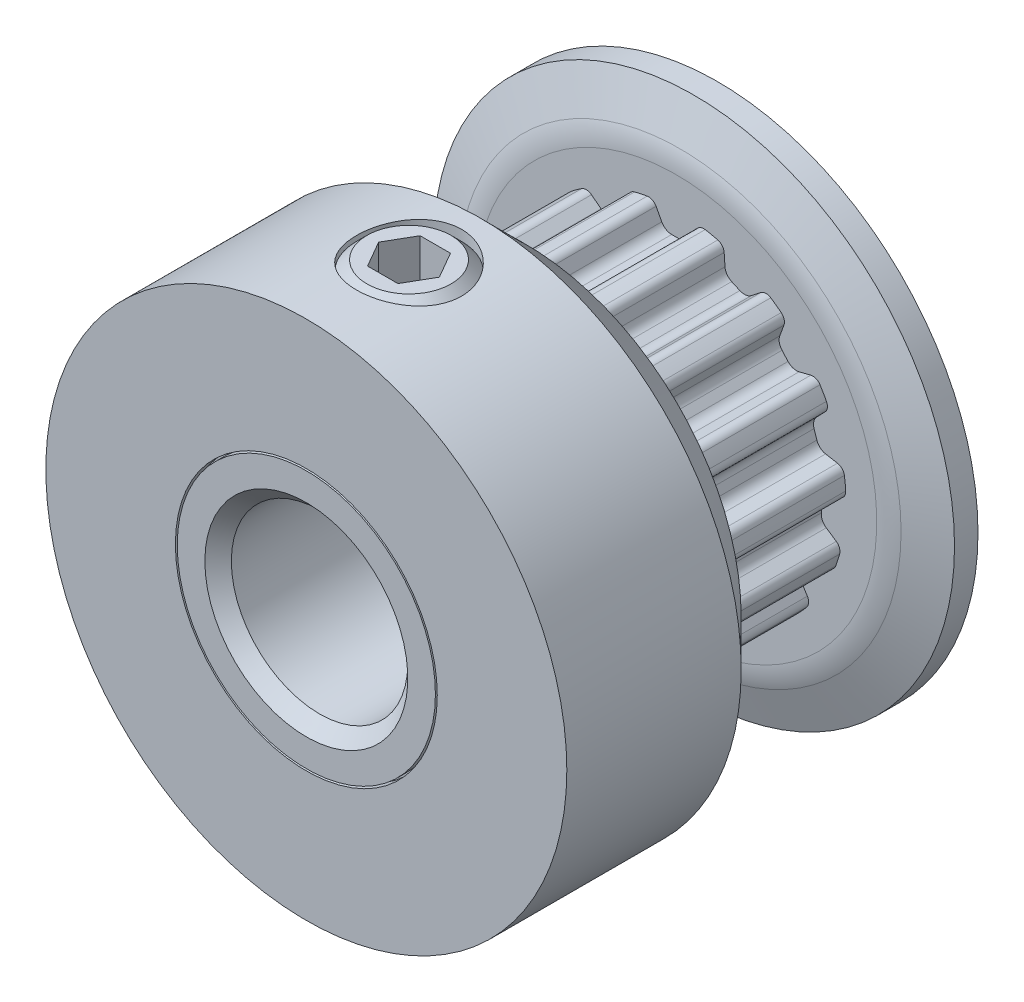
from build123d import *

# Parameters (mm, degrees)
SKETCH1_W          = 5.9436
SKETCH1_H          = 4.6609
EXTRUDE1_START     = -11.1252
SKETCH2_R          = 4.5974
SKETCH2_R_2        = 2.3876
EXTRUDE1_DEPTH     = 11.1252
CUT_EXTRUDE1_START = -4.064
CUT_EXTRUDE1_DEPTH = 4.064
CIRPATTERN1_COUNT  = 15
SKETCH4_R          = 7.0485
SKETCH4_R_2        = 3.7592
CUT_EXTRUDE2_DEPTH = 15.12496946
CHAMFER1_SIZE      = 1.22555
FILLET1_R          = 1.64465
SKETCH6_R          = 3.5433
SKETCH6_R_2        = 3.4925
CUT_EXTRUDE3_DEPTH = 0.254
SKETCH7_R          = 1.4224
CUT_EXTRUDE4_DEPTH = 12.605562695
CUT_EXTRUDE5_DEPTH = 1.4224
CHAMFER2_SIZE      = 0.35814


with BuildPart() as part:
    # Sketch1 → Revolve1 (revolve)
    with BuildSketch(Plane(origin=(0, 0, 0), x_dir=(0, 0, -1), z_dir=(1, 0, 0)), mode=Mode.PRIVATE) as revolve1_sk:
        with Locations((-2.9718, 4.71805)):
            Rectangle(SKETCH1_W, SKETCH1_H)
    revolve(revolve1_sk.sketch.rotate(Axis((0, 0, 6.24078), (0, 0, -1)), 90), axis=Axis((0, 0, 6.24078), (0, 0, -1)))

    # Sketch2 → Extrude1 (add)
    with BuildSketch(Plane.XY.offset(5.9436).offset(EXTRUDE1_START)):
        Circle(SKETCH2_R)
        Circle(SKETCH2_R_2, mode=Mode.SUBTRACT)
    extrude(amount=EXTRUDE1_DEPTH)

    # Sketch3 → Cut-Extrude1 (cut)
    with BuildSketch(Plane(origin=(0, 0, 0), x_dir=(0.913545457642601, -0.40673664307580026, 0), z_dir=(0, 0, 1)).offset(CUT_EXTRUDE1_START)):
        with BuildLine():
            Line((0.121657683, 3.9624), (-0.121657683, 3.9624))
            ThreePointArc((-0.121657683, 3.9624), (-0.278641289, 4.005935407), (-0.39078011, 4.124105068))
            Line((-0.39078011, 4.124105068), (-0.543861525, 4.412009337))
            ThreePointArc((-0.543861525, 4.412009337), (-0.645183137, 4.510001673), (-0.784722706, 4.529933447))
            ThreePointArc((-0.784722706, 4.529933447), (0, 4.5974), (0.784722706, 4.529933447))
            ThreePointArc((0.784722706, 4.529933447), (0.645183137, 4.510001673), (0.543861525, 4.412009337))
            Line((0.543861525, 4.412009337), (0.39078011, 4.124105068))
            ThreePointArc((0.39078011, 4.124105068), (0.278641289, 4.005935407), (0.121657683, 3.9624))
        make_face()
    cut_extrude1 = extrude(amount=CUT_EXTRUDE1_DEPTH, mode=Mode.SUBTRACT)

    # CirPattern1: Cut-Extrude1 ×15 about axis
    cirpattern1_axis = Axis((0, 0, 0), (0, 0, 1))
    for i in range(1, CIRPATTERN1_COUNT):
        add(cut_extrude1.rotate(cirpattern1_axis, i * 360 / CIRPATTERN1_COUNT), mode=Mode.SUBTRACT)

    # Sketch4 → Cut-Extrude2 (cut, through all)
    with BuildSketch(Plane.XY.offset(-4.064)):
        Circle(SKETCH4_R)
        Circle(SKETCH4_R_2, mode=Mode.SUBTRACT)
    extrude(amount=-CUT_EXTRUDE2_DEPTH, mode=Mode.SUBTRACT)

    # Sketch5 → Revolve2 (revolve)
    with BuildSketch(Plane(origin=(0, 0, 0), x_dir=(0, 0, -1), z_dir=(1, 0, 0)), mode=Mode.PRIVATE) as revolve2_sk:
        Polygon((4.064, 3.7592), (4.064, 5.715), (4.5466, 7.0485), (5.1816, 7.0485), (4.699, 5.715), (4.699, 3.7592), align=None)
    revolve(revolve2_sk.sketch.rotate(Axis((0, 0, -4.00812), (0, 0, -1)), 90), axis=Axis((0, 0, -4.00812), (0, 0, -1)))

    # Chamfer1
    chamfer1_edges = [part.edges().sort_by_distance(p)[0] for p in [
        (-7.0485, 0, 0),
    ]]
    chamfer(chamfer1_edges, length=CHAMFER1_SIZE)

    # Fillet1
    fillet1_edges = [part.edges().sort_by_distance(p)[0] for p in [
        (-5.715, 0, -4.064),
    ]]
    fillet(fillet1_edges, radius=FILLET1_R)

    # Sketch6 → Cut-Extrude3 (cut)
    with BuildSketch(Plane.XY.offset(5.9436)):
        Circle(SKETCH6_R)
        Circle(SKETCH6_R_2, mode=Mode.SUBTRACT)
    extrude(amount=-CUT_EXTRUDE3_DEPTH, mode=Mode.SUBTRACT)

    # Sketch7 → Cut-Extrude4 (cut, through all)
    with BuildSketch(Plane(origin=(0, 0, 0), x_dir=(0, 0, 1), z_dir=(0, -1, 0))):
        with Locations(Location((3.165475, 0, 0), (0, 0, 180))):
            Circle(SKETCH7_R)
    extrude(amount=-CUT_EXTRUDE4_DEPTH, mode=Mode.SUBTRACT)

    # Sketch8 → Revolve3 (revolve)
    with BuildSketch(Plane.XY.offset(3.165475), mode=Mode.PRIVATE) as revolve3_sk:
        Polygon((0, 7.0485), (-1.13792, 7.0485), (-1.4224, 6.76402), (-1.4224, 2.67208), (-1.13792, 2.3876), (0, 2.3876), align=None)
    revolve(revolve3_sk.sketch.rotate(Axis((0, 2.154555, 3.165475), (0, 1, 0)), 270), axis=Axis((0, 2.154555, 3.165475), (0, 1, 0)))

    # Sketch9 → Cut-Extrude5 (cut)
    with BuildSketch(Plane(origin=(0, 7.0485, 0), x_dir=(-1, 0, 0), z_dir=(0, 1, 0))):
        Polygon((0.410611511, 2.454275), (-0.410611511, 2.454275), (-0.821223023, 3.165475), (-0.410611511, 3.876675), (0.410611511, 3.876675), (0.821223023, 3.165475), align=None)
    extrude(amount=-CUT_EXTRUDE5_DEPTH, mode=Mode.SUBTRACT)

    # Chamfer2
    chamfer2_edges = [part.edges().sort_by_distance(p)[0] for p in [
        (-2.3876, 0, -5.1816),
        (-2.3876, 0, 5.9436),
    ]]
    chamfer(chamfer2_edges, length=CHAMFER2_SIZE)


solid = part.part
